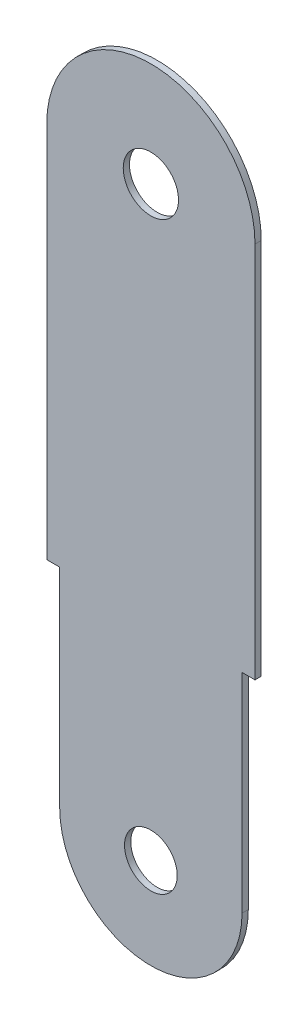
ISO-10303-21;
HEADER;
FILE_DESCRIPTION(('STEP AP214'),'2;1');
FILE_NAME('part.step','',(''),(''),'','','');
FILE_SCHEMA(('AUTOMOTIVE_DESIGN { 1 0 10303 214 1 1 1 1 }'));
ENDSEC;
DATA;
#1=APPLICATION_CONTEXT('core data for automotive mechanical design processes');
#2=APPLICATION_PROTOCOL_DEFINITION('international standard','automotive_design',2000,#1);
#3=PRODUCT_CONTEXT('',#1,'mechanical');
#4=PRODUCT('Part','Part','',(#3));
#5=PRODUCT_RELATED_PRODUCT_CATEGORY('part','',(#4));
#6=PRODUCT_DEFINITION_FORMATION('','',#4);
#7=PRODUCT_DEFINITION_CONTEXT('part definition',#1,'design');
#8=PRODUCT_DEFINITION('design','',#6,#7);
#9=PRODUCT_DEFINITION_SHAPE('','',#8);
#10=(LENGTH_UNIT() NAMED_UNIT(*) SI_UNIT(.MILLI.,.METRE.));
#11=(NAMED_UNIT(*) PLANE_ANGLE_UNIT() SI_UNIT($,.RADIAN.));
#12=(NAMED_UNIT(*) SI_UNIT($,.STERADIAN.) SOLID_ANGLE_UNIT());
#13=UNCERTAINTY_MEASURE_WITH_UNIT(LENGTH_MEASURE(1.E-05),#10,'distance_accuracy_value','');
#14=(GEOMETRIC_REPRESENTATION_CONTEXT(3) GLOBAL_UNCERTAINTY_ASSIGNED_CONTEXT((#13)) GLOBAL_UNIT_ASSIGNED_CONTEXT((#10,
#11,#12)) REPRESENTATION_CONTEXT('',''));
#15=CARTESIAN_POINT('',(0.,0.,0.));
#16=DIRECTION('',(0.,0.,1.));
#17=DIRECTION('',(1.,0.,0.));
#18=AXIS2_PLACEMENT_3D('',#15,#16,#17);
#19=CARTESIAN_POINT('',(-59.4530686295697,-35.0116548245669,1.524));
#20=DIRECTION('',(0.,0.,1.));
#21=DIRECTION('',(1.,0.,0.));
#22=AXIS2_PLACEMENT_3D('',#19,#20,#21);
#23=PLANE('',#22);
#24=CARTESIAN_POINT('',(-59.4530686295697,-35.0116548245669,1.524));
#25=DIRECTION('',(0.,0.,1.));
#26=DIRECTION('',(1.,0.,0.));
#27=AXIS2_PLACEMENT_3D('',#24,#25,#26);
#28=CIRCLE('',#27,6.7437);
#29=CARTESIAN_POINT('',(-66.1967686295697,-35.0116548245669,1.524));
#30=VERTEX_POINT('',#29);
#31=EDGE_CURVE('E135',#30,#30,#28,.T.);
#32=ORIENTED_EDGE('',*,*,#31,.F.);
#33=EDGE_LOOP('',(#32));
#34=FACE_BOUND('',#33,.T.);
#35=CARTESIAN_POINT('',(-59.4530686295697,-35.0116548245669,1.524));
#36=DIRECTION('',(0.,0.,1.));
#37=DIRECTION('',(1.,0.,0.));
#38=AXIS2_PLACEMENT_3D('',#35,#36,#37);
#39=CIRCLE('',#38,25.4);
#40=CARTESIAN_POINT('',(-34.0530686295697,-35.0116548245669,1.524));
#41=VERTEX_POINT('',#40);
#42=CARTESIAN_POINT('',(-84.8530686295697,-35.0116548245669,1.524));
#43=VERTEX_POINT('',#42);
#44=EDGE_CURVE('E146',#41,#43,#39,.T.);
#45=ORIENTED_EDGE('',*,*,#44,.T.);
#46=DIRECTION('',(0.,-1.,0.));
#47=VECTOR('',#46,1.);
#48=CARTESIAN_POINT('',(-84.8530686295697,-35.0116548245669,1.524));
#49=LINE('',#48,#47);
#50=CARTESIAN_POINT('',(-84.8530686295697,-127.07412463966,1.524));
#51=VERTEX_POINT('',#50);
#52=EDGE_CURVE('E94',#43,#51,#49,.T.);
#53=ORIENTED_EDGE('',*,*,#52,.T.);
#54=DIRECTION('',(1.,0.,0.));
#55=VECTOR('',#54,1.);
#56=CARTESIAN_POINT('',(-84.8530686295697,-127.07412463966,1.524));
#57=LINE('',#56,#55);
#58=CARTESIAN_POINT('',(-81.6948110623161,-127.07412463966,1.524));
#59=VERTEX_POINT('',#58);
#60=EDGE_CURVE('E161',#51,#59,#57,.T.);
#61=ORIENTED_EDGE('',*,*,#60,.T.);
#62=DIRECTION('',(0.,-1.,0.));
#63=VECTOR('',#62,1.);
#64=CARTESIAN_POINT('',(-81.6948110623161,-127.07412463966,1.524));
#65=LINE('',#64,#63);
#66=CARTESIAN_POINT('',(-81.6948110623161,-177.922739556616,1.524));
#67=VERTEX_POINT('',#66);
#68=EDGE_CURVE('E174',#59,#67,#65,.T.);
#69=ORIENTED_EDGE('',*,*,#68,.T.);
#70=CARTESIAN_POINT('',(-59.4530686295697,-177.922739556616,1.524));
#71=DIRECTION('',(0.,0.,1.));
#72=DIRECTION('',(1.,0.,0.));
#73=AXIS2_PLACEMENT_3D('',#70,#71,#72);
#74=CIRCLE('',#73,22.2417424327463);
#75=CARTESIAN_POINT('',(-37.2113261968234,-177.922739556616,1.524));
#76=VERTEX_POINT('',#75);
#77=EDGE_CURVE('E113',#67,#76,#74,.T.);
#78=ORIENTED_EDGE('',*,*,#77,.T.);
#79=DIRECTION('',(0.,1.,0.));
#80=VECTOR('',#79,1.);
#81=CARTESIAN_POINT('',(-37.2113261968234,-127.07412463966,1.524));
#82=LINE('',#81,#80);
#83=CARTESIAN_POINT('',(-37.2113261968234,-127.07412463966,1.524));
#84=VERTEX_POINT('',#83);
#85=EDGE_CURVE('E107',#76,#84,#82,.T.);
#86=ORIENTED_EDGE('',*,*,#85,.T.);
#87=DIRECTION('',(1.,0.,0.));
#88=VECTOR('',#87,1.);
#89=CARTESIAN_POINT('',(-34.0530686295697,-127.07412463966,1.524));
#90=LINE('',#89,#88);
#91=CARTESIAN_POINT('',(-34.0530686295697,-127.07412463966,1.524));
#92=VERTEX_POINT('',#91);
#93=EDGE_CURVE('E111',#84,#92,#90,.T.);
#94=ORIENTED_EDGE('',*,*,#93,.T.);
#95=DIRECTION('',(0.,1.,0.));
#96=VECTOR('',#95,1.);
#97=CARTESIAN_POINT('',(-34.0530686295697,-35.0116548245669,1.524));
#98=LINE('',#97,#96);
#99=EDGE_CURVE('E51',#92,#41,#98,.T.);
#100=ORIENTED_EDGE('',*,*,#99,.T.);
#101=EDGE_LOOP('',(#45,#53,#61,#69,#78,#86,#94,#100));
#102=FACE_BOUND('',#101,.T.);
#103=CARTESIAN_POINT('',(-59.4530686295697,-177.922739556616,1.524));
#104=DIRECTION('',(0.,0.,1.));
#105=DIRECTION('',(1.,0.,0.));
#106=AXIS2_PLACEMENT_3D('',#103,#104,#105);
#107=CIRCLE('',#106,6.42619999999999);
#108=CARTESIAN_POINT('',(-65.8792686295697,-177.922739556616,1.524));
#109=VERTEX_POINT('',#108);
#110=EDGE_CURVE('E183',#109,#109,#107,.T.);
#111=ORIENTED_EDGE('',*,*,#110,.F.);
#112=EDGE_LOOP('',(#111));
#113=FACE_BOUND('',#112,.T.);
#114=ADVANCED_FACE('F34',(#34,#102,#113),#23,.T.);
#115=CARTESIAN_POINT('',(-59.4530686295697,-35.0116548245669,0.));
#116=DIRECTION('',(0.,0.,1.));
#117=DIRECTION('',(1.,0.,0.));
#118=AXIS2_PLACEMENT_3D('',#115,#116,#117);
#119=PLANE('',#118);
#120=CARTESIAN_POINT('',(-59.4530686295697,-35.0116548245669,0.));
#121=DIRECTION('',(0.,0.,1.));
#122=DIRECTION('',(1.,0.,0.));
#123=AXIS2_PLACEMENT_3D('',#120,#121,#122);
#124=CIRCLE('',#123,6.7437);
#125=CARTESIAN_POINT('',(-66.1967686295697,-35.0116548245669,0.));
#126=VERTEX_POINT('',#125);
#127=EDGE_CURVE('E180',#126,#126,#124,.T.);
#128=ORIENTED_EDGE('',*,*,#127,.T.);
#129=EDGE_LOOP('',(#128));
#130=FACE_BOUND('',#129,.T.);
#131=CARTESIAN_POINT('',(-59.4530686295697,-35.0116548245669,0.));
#132=DIRECTION('',(0.,0.,1.));
#133=DIRECTION('',(1.,0.,0.));
#134=AXIS2_PLACEMENT_3D('',#131,#132,#133);
#135=CIRCLE('',#134,25.4);
#136=CARTESIAN_POINT('',(-34.0530686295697,-35.0116548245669,0.));
#137=VERTEX_POINT('',#136);
#138=CARTESIAN_POINT('',(-84.8530686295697,-35.0116548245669,0.));
#139=VERTEX_POINT('',#138);
#140=EDGE_CURVE('E131',#137,#139,#135,.T.);
#141=ORIENTED_EDGE('',*,*,#140,.F.);
#142=DIRECTION('',(0.,1.,0.));
#143=VECTOR('',#142,1.);
#144=CARTESIAN_POINT('',(-34.0530686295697,-35.0116548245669,0.));
#145=LINE('',#144,#143);
#146=CARTESIAN_POINT('',(-34.0530686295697,-127.07412463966,0.));
#147=VERTEX_POINT('',#146);
#148=EDGE_CURVE('E86',#147,#137,#145,.T.);
#149=ORIENTED_EDGE('',*,*,#148,.F.);
#150=DIRECTION('',(1.,0.,0.));
#151=VECTOR('',#150,1.);
#152=CARTESIAN_POINT('',(-34.0530686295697,-127.07412463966,0.));
#153=LINE('',#152,#151);
#154=CARTESIAN_POINT('',(-37.2113261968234,-127.07412463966,0.));
#155=VERTEX_POINT('',#154);
#156=EDGE_CURVE('E80',#155,#147,#153,.T.);
#157=ORIENTED_EDGE('',*,*,#156,.F.);
#158=DIRECTION('',(0.,1.,0.));
#159=VECTOR('',#158,1.);
#160=CARTESIAN_POINT('',(-37.2113261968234,-127.07412463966,0.));
#161=LINE('',#160,#159);
#162=CARTESIAN_POINT('',(-37.2113261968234,-177.922739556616,0.));
#163=VERTEX_POINT('',#162);
#164=EDGE_CURVE('E121',#163,#155,#161,.T.);
#165=ORIENTED_EDGE('',*,*,#164,.F.);
#166=CARTESIAN_POINT('',(-59.4530686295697,-177.922739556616,0.));
#167=DIRECTION('',(0.,0.,1.));
#168=DIRECTION('',(1.,0.,0.));
#169=AXIS2_PLACEMENT_3D('',#166,#167,#168);
#170=CIRCLE('',#169,22.2417424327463);
#171=CARTESIAN_POINT('',(-81.6948110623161,-177.922739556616,0.));
#172=VERTEX_POINT('',#171);
#173=EDGE_CURVE('E141',#172,#163,#170,.T.);
#174=ORIENTED_EDGE('',*,*,#173,.F.);
#175=DIRECTION('',(0.,-1.,0.));
#176=VECTOR('',#175,1.);
#177=CARTESIAN_POINT('',(-81.6948110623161,-127.07412463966,0.));
#178=LINE('',#177,#176);
#179=CARTESIAN_POINT('',(-81.6948110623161,-127.07412463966,0.));
#180=VERTEX_POINT('',#179);
#181=EDGE_CURVE('E139',#180,#172,#178,.T.);
#182=ORIENTED_EDGE('',*,*,#181,.F.);
#183=DIRECTION('',(1.,0.,0.));
#184=VECTOR('',#183,1.);
#185=CARTESIAN_POINT('',(-84.8530686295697,-127.07412463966,0.));
#186=LINE('',#185,#184);
#187=CARTESIAN_POINT('',(-84.8530686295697,-127.07412463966,0.));
#188=VERTEX_POINT('',#187);
#189=EDGE_CURVE('E137',#188,#180,#186,.T.);
#190=ORIENTED_EDGE('',*,*,#189,.F.);
#191=DIRECTION('',(0.,-1.,0.));
#192=VECTOR('',#191,1.);
#193=CARTESIAN_POINT('',(-84.8530686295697,-35.0116548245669,0.));
#194=LINE('',#193,#192);
#195=EDGE_CURVE('E134',#139,#188,#194,.T.);
#196=ORIENTED_EDGE('',*,*,#195,.F.);
#197=EDGE_LOOP('',(#141,#149,#157,#165,#174,#182,#190,#196));
#198=FACE_BOUND('',#197,.T.);
#199=CARTESIAN_POINT('',(-59.4530686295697,-177.922739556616,0.));
#200=DIRECTION('',(0.,0.,1.));
#201=DIRECTION('',(1.,0.,0.));
#202=AXIS2_PLACEMENT_3D('',#199,#200,#201);
#203=CIRCLE('',#202,6.42619999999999);
#204=CARTESIAN_POINT('',(-65.8792686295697,-177.922739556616,0.));
#205=VERTEX_POINT('',#204);
#206=EDGE_CURVE('E186',#205,#205,#203,.T.);
#207=ORIENTED_EDGE('',*,*,#206,.T.);
#208=EDGE_LOOP('',(#207));
#209=FACE_BOUND('',#208,.T.);
#210=ADVANCED_FACE('F165',(#130,#198,#209),#119,.F.);
#211=CARTESIAN_POINT('',(-59.4530686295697,-35.0116548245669,1.524));
#212=DIRECTION('',(0.,0.,-1.));
#213=DIRECTION('',(-1.,0.,0.));
#214=AXIS2_PLACEMENT_3D('',#211,#212,#213);
#215=CYLINDRICAL_SURFACE('',#214,25.4);
#216=ORIENTED_EDGE('',*,*,#140,.T.);
#217=DIRECTION('',(0.,0.,-1.));
#218=VECTOR('',#217,1.);
#219=CARTESIAN_POINT('',(-84.8530686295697,-35.0116548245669,1.524));
#220=LINE('',#219,#218);
#221=EDGE_CURVE('E11',#43,#139,#220,.T.);
#222=ORIENTED_EDGE('',*,*,#221,.F.);
#223=ORIENTED_EDGE('',*,*,#44,.F.);
#224=DIRECTION('',(0.,0.,-1.));
#225=VECTOR('',#224,1.);
#226=CARTESIAN_POINT('',(-34.0530686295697,-35.0116548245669,1.524));
#227=LINE('',#226,#225);
#228=EDGE_CURVE('E127',#41,#137,#227,.T.);
#229=ORIENTED_EDGE('',*,*,#228,.T.);
#230=EDGE_LOOP('',(#216,#222,#223,#229));
#231=FACE_BOUND('',#230,.T.);
#232=ADVANCED_FACE('F36',(#231),#215,.T.);
#233=CARTESIAN_POINT('',(-84.8530686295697,-35.0116548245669,1.524));
#234=DIRECTION('',(1.,0.,0.));
#235=DIRECTION('',(0.,0.,-1.));
#236=AXIS2_PLACEMENT_3D('',#233,#234,#235);
#237=PLANE('',#236);
#238=ORIENTED_EDGE('',*,*,#195,.T.);
#239=DIRECTION('',(0.,0.,-1.));
#240=VECTOR('',#239,1.);
#241=CARTESIAN_POINT('',(-84.8530686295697,-127.07412463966,1.524));
#242=LINE('',#241,#240);
#243=EDGE_CURVE('E43',#51,#188,#242,.T.);
#244=ORIENTED_EDGE('',*,*,#243,.F.);
#245=ORIENTED_EDGE('',*,*,#52,.F.);
#246=ORIENTED_EDGE('',*,*,#221,.T.);
#247=EDGE_LOOP('',(#238,#244,#245,#246));
#248=FACE_BOUND('',#247,.T.);
#249=ADVANCED_FACE('F219',(#248),#237,.F.);
#250=CARTESIAN_POINT('',(-84.8530686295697,-127.07412463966,1.524));
#251=DIRECTION('',(0.,1.,0.));
#252=DIRECTION('',(0.,0.,1.));
#253=AXIS2_PLACEMENT_3D('',#250,#251,#252);
#254=PLANE('',#253);
#255=ORIENTED_EDGE('',*,*,#189,.T.);
#256=DIRECTION('',(0.,0.,-1.));
#257=VECTOR('',#256,1.);
#258=CARTESIAN_POINT('',(-81.6948110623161,-127.07412463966,1.524));
#259=LINE('',#258,#257);
#260=EDGE_CURVE('E153',#59,#180,#259,.T.);
#261=ORIENTED_EDGE('',*,*,#260,.F.);
#262=ORIENTED_EDGE('',*,*,#60,.F.);
#263=ORIENTED_EDGE('',*,*,#243,.T.);
#264=EDGE_LOOP('',(#255,#261,#262,#263));
#265=FACE_BOUND('',#264,.T.);
#266=ADVANCED_FACE('F159',(#265),#254,.F.);
#267=CARTESIAN_POINT('',(-81.6948110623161,-127.07412463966,1.524));
#268=DIRECTION('',(1.,0.,0.));
#269=DIRECTION('',(0.,0.,-1.));
#270=AXIS2_PLACEMENT_3D('',#267,#268,#269);
#271=PLANE('',#270);
#272=ORIENTED_EDGE('',*,*,#181,.T.);
#273=DIRECTION('',(0.,0.,-1.));
#274=VECTOR('',#273,1.);
#275=CARTESIAN_POINT('',(-81.6948110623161,-177.922739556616,1.524));
#276=LINE('',#275,#274);
#277=EDGE_CURVE('E150',#67,#172,#276,.T.);
#278=ORIENTED_EDGE('',*,*,#277,.F.);
#279=ORIENTED_EDGE('',*,*,#68,.F.);
#280=ORIENTED_EDGE('',*,*,#260,.T.);
#281=EDGE_LOOP('',(#272,#278,#279,#280));
#282=FACE_BOUND('',#281,.T.);
#283=ADVANCED_FACE('F170',(#282),#271,.F.);
#284=CARTESIAN_POINT('',(-59.4530686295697,-177.922739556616,1.524));
#285=DIRECTION('',(0.,0.,-1.));
#286=DIRECTION('',(-1.,0.,0.));
#287=AXIS2_PLACEMENT_3D('',#284,#285,#286);
#288=CYLINDRICAL_SURFACE('',#287,22.2417424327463);
#289=ORIENTED_EDGE('',*,*,#173,.T.);
#290=DIRECTION('',(0.,0.,-1.));
#291=VECTOR('',#290,1.);
#292=CARTESIAN_POINT('',(-37.2113261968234,-177.922739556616,1.524));
#293=LINE('',#292,#291);
#294=EDGE_CURVE('E122',#76,#163,#293,.T.);
#295=ORIENTED_EDGE('',*,*,#294,.F.);
#296=ORIENTED_EDGE('',*,*,#77,.F.);
#297=ORIENTED_EDGE('',*,*,#277,.T.);
#298=EDGE_LOOP('',(#289,#295,#296,#297));
#299=FACE_BOUND('',#298,.T.);
#300=ADVANCED_FACE('F173',(#299),#288,.T.);
#301=CARTESIAN_POINT('',(-37.2113261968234,-127.07412463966,1.524));
#302=DIRECTION('',(-1.,0.,0.));
#303=DIRECTION('',(0.,-1.,0.));
#304=AXIS2_PLACEMENT_3D('',#301,#302,#303);
#305=PLANE('',#304);
#306=ORIENTED_EDGE('',*,*,#164,.T.);
#307=DIRECTION('',(0.,0.,-1.));
#308=VECTOR('',#307,1.);
#309=CARTESIAN_POINT('',(-37.2113261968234,-127.07412463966,1.524));
#310=LINE('',#309,#308);
#311=EDGE_CURVE('E118',#84,#155,#310,.T.);
#312=ORIENTED_EDGE('',*,*,#311,.F.);
#313=ORIENTED_EDGE('',*,*,#85,.F.);
#314=ORIENTED_EDGE('',*,*,#294,.T.);
#315=EDGE_LOOP('',(#306,#312,#313,#314));
#316=FACE_BOUND('',#315,.T.);
#317=ADVANCED_FACE('F119',(#316),#305,.F.);
#318=CARTESIAN_POINT('',(-34.0530686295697,-127.07412463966,1.524));
#319=DIRECTION('',(0.,1.,0.));
#320=DIRECTION('',(-1.,0.,0.));
#321=AXIS2_PLACEMENT_3D('',#318,#319,#320);
#322=PLANE('',#321);
#323=ORIENTED_EDGE('',*,*,#156,.T.);
#324=DIRECTION('',(0.,0.,-1.));
#325=VECTOR('',#324,1.);
#326=CARTESIAN_POINT('',(-34.0530686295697,-127.07412463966,1.524));
#327=LINE('',#326,#325);
#328=EDGE_CURVE('E123',#92,#147,#327,.T.);
#329=ORIENTED_EDGE('',*,*,#328,.F.);
#330=ORIENTED_EDGE('',*,*,#93,.F.);
#331=ORIENTED_EDGE('',*,*,#311,.T.);
#332=EDGE_LOOP('',(#323,#329,#330,#331));
#333=FACE_BOUND('',#332,.T.);
#334=ADVANCED_FACE('F125',(#333),#322,.F.);
#335=CARTESIAN_POINT('',(-34.0530686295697,-35.0116548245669,1.524));
#336=DIRECTION('',(-1.,0.,0.));
#337=DIRECTION('',(0.,0.,1.));
#338=AXIS2_PLACEMENT_3D('',#335,#336,#337);
#339=PLANE('',#338);
#340=ORIENTED_EDGE('',*,*,#148,.T.);
#341=ORIENTED_EDGE('',*,*,#228,.F.);
#342=ORIENTED_EDGE('',*,*,#99,.F.);
#343=ORIENTED_EDGE('',*,*,#328,.T.);
#344=EDGE_LOOP('',(#340,#341,#342,#343));
#345=FACE_BOUND('',#344,.T.);
#346=ADVANCED_FACE('F207',(#345),#339,.F.);
#347=CARTESIAN_POINT('',(-59.4530686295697,-35.0116548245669,1.524));
#348=DIRECTION('',(0.,0.,-1.));
#349=DIRECTION('',(-1.,0.,0.));
#350=AXIS2_PLACEMENT_3D('',#347,#348,#349);
#351=CYLINDRICAL_SURFACE('',#350,6.7437);
#352=CARTESIAN_POINT('',(-66.1967686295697,-35.0116548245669,1.524));
#353=CARTESIAN_POINT('',(-66.1967686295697,-35.0116548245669,1.508125));
#354=CARTESIAN_POINT('',(-66.1967686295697,-35.0116548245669,1.49225));
#355=CARTESIAN_POINT('',(-66.1967686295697,-35.0116548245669,1.4605));
#356=CARTESIAN_POINT('',(-66.1967686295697,-35.0116548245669,1.444625));
#357=CARTESIAN_POINT('',(-66.1967686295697,-35.0116548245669,1.412875));
#358=CARTESIAN_POINT('',(-66.1967686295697,-35.0116548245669,1.397));
#359=CARTESIAN_POINT('',(-66.1967686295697,-35.0116548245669,1.36525));
#360=CARTESIAN_POINT('',(-66.1967686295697,-35.0116548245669,1.349375));
#361=CARTESIAN_POINT('',(-66.1967686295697,-35.0116548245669,1.317625));
#362=CARTESIAN_POINT('',(-66.1967686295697,-35.0116548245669,1.30175));
#363=CARTESIAN_POINT('',(-66.1967686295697,-35.0116548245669,1.27));
#364=CARTESIAN_POINT('',(-66.1967686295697,-35.0116548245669,1.254125));
#365=CARTESIAN_POINT('',(-66.1967686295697,-35.0116548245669,1.222375));
#366=CARTESIAN_POINT('',(-66.1967686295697,-35.0116548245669,1.2065));
#367=CARTESIAN_POINT('',(-66.1967686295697,-35.0116548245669,1.17475));
#368=CARTESIAN_POINT('',(-66.1967686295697,-35.0116548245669,1.158875));
#369=CARTESIAN_POINT('',(-66.1967686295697,-35.0116548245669,1.127125));
#370=CARTESIAN_POINT('',(-66.1967686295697,-35.0116548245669,1.11125));
#371=CARTESIAN_POINT('',(-66.1967686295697,-35.0116548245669,1.0795));
#372=CARTESIAN_POINT('',(-66.1967686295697,-35.0116548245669,1.063625));
#373=CARTESIAN_POINT('',(-66.1967686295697,-35.0116548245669,1.031875));
#374=CARTESIAN_POINT('',(-66.1967686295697,-35.0116548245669,1.016));
#375=CARTESIAN_POINT('',(-66.1967686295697,-35.0116548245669,0.98425));
#376=CARTESIAN_POINT('',(-66.1967686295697,-35.0116548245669,0.968375));
#377=CARTESIAN_POINT('',(-66.1967686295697,-35.0116548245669,0.936625));
#378=CARTESIAN_POINT('',(-66.1967686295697,-35.0116548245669,0.92075));
#379=CARTESIAN_POINT('',(-66.1967686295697,-35.0116548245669,0.889));
#380=CARTESIAN_POINT('',(-66.1967686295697,-35.0116548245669,0.873125));
#381=CARTESIAN_POINT('',(-66.1967686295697,-35.0116548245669,0.841375));
#382=CARTESIAN_POINT('',(-66.1967686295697,-35.0116548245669,0.8255));
#383=CARTESIAN_POINT('',(-66.1967686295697,-35.0116548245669,0.79375));
#384=CARTESIAN_POINT('',(-66.1967686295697,-35.0116548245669,0.777875));
#385=CARTESIAN_POINT('',(-66.1967686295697,-35.0116548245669,0.746125));
#386=CARTESIAN_POINT('',(-66.1967686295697,-35.0116548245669,0.73025));
#387=CARTESIAN_POINT('',(-66.1967686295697,-35.0116548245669,0.6985));
#388=CARTESIAN_POINT('',(-66.1967686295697,-35.0116548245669,0.682625));
#389=CARTESIAN_POINT('',(-66.1967686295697,-35.0116548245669,0.650875));
#390=CARTESIAN_POINT('',(-66.1967686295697,-35.0116548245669,0.635));
#391=CARTESIAN_POINT('',(-66.1967686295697,-35.0116548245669,0.60325));
#392=CARTESIAN_POINT('',(-66.1967686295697,-35.0116548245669,0.587375));
#393=CARTESIAN_POINT('',(-66.1967686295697,-35.0116548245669,0.555625));
#394=CARTESIAN_POINT('',(-66.1967686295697,-35.0116548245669,0.53975));
#395=CARTESIAN_POINT('',(-66.1967686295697,-35.0116548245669,0.508));
#396=CARTESIAN_POINT('',(-66.1967686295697,-35.0116548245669,0.492125));
#397=CARTESIAN_POINT('',(-66.1967686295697,-35.0116548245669,0.460375));
#398=CARTESIAN_POINT('',(-66.1967686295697,-35.0116548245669,0.4445));
#399=CARTESIAN_POINT('',(-66.1967686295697,-35.0116548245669,0.41275));
#400=CARTESIAN_POINT('',(-66.1967686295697,-35.0116548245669,0.396875));
#401=CARTESIAN_POINT('',(-66.1967686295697,-35.0116548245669,0.365125));
#402=CARTESIAN_POINT('',(-66.1967686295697,-35.0116548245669,0.34925));
#403=CARTESIAN_POINT('',(-66.1967686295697,-35.0116548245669,0.3175));
#404=CARTESIAN_POINT('',(-66.1967686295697,-35.0116548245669,0.301625));
#405=CARTESIAN_POINT('',(-66.1967686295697,-35.0116548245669,0.269875));
#406=CARTESIAN_POINT('',(-66.1967686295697,-35.0116548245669,0.254));
#407=CARTESIAN_POINT('',(-66.1967686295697,-35.0116548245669,0.22225));
#408=CARTESIAN_POINT('',(-66.1967686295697,-35.0116548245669,0.206375));
#409=CARTESIAN_POINT('',(-66.1967686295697,-35.0116548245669,0.174625));
#410=CARTESIAN_POINT('',(-66.1967686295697,-35.0116548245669,0.15875));
#411=CARTESIAN_POINT('',(-66.1967686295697,-35.0116548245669,0.127));
#412=CARTESIAN_POINT('',(-66.1967686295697,-35.0116548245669,0.111125));
#413=CARTESIAN_POINT('',(-66.1967686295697,-35.0116548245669,0.079375));
#414=CARTESIAN_POINT('',(-66.1967686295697,-35.0116548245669,0.0635));
#415=CARTESIAN_POINT('',(-66.1967686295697,-35.0116548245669,0.0317499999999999));
#416=CARTESIAN_POINT('',(-66.1967686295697,-35.0116548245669,0.015875));
#417=CARTESIAN_POINT('',(-66.1967686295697,-35.0116548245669,0.));
#418=B_SPLINE_CURVE_WITH_KNOTS('',3,(#352,#353,#354,#355,#356,#357,#358,#359,#360,#361,#362,
#363,#364,#365,#366,#367,#368,#369,#370,#371,#372,#373,#374,#375,#376,#377,#378,#379,#380,#381,
#382,#383,#384,#385,#386,#387,#388,#389,#390,#391,#392,#393,#394,#395,#396,#397,#398,#399,#400,
#401,#402,#403,#404,#405,#406,#407,#408,#409,#410,#411,#412,#413,#414,#415,#416,#417),
.UNSPECIFIED.,.F.,.F.,(4,2,2,2,2,2,2,2,2,2,2,2,2,2,2,2,2,2,2,2,2,2,2,2,2,2,2,2,2,2,2,2,4),(0.,
0.0476249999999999,0.0952499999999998,0.142875,0.1905,0.238125,0.28575,0.333375,0.381,0.428625,
0.47625,0.523875,0.5715,0.619125,0.66675,0.714375,0.762,0.809625,0.85725,0.904875,0.9525,
1.000125,1.04775,1.095375,1.143,1.190625,1.23825,1.285875,1.3335,1.381125,1.42875,1.476375,
1.524),.UNSPECIFIED.);
#419=EDGE_CURVE('BSEAM204',#30,#126,#418,.T.);
#420=ORIENTED_EDGE('',*,*,#31,.T.);
#421=ORIENTED_EDGE('',*,*,#127,.F.);
#422=ORIENTED_EDGE('',*,*,#419,.T.);
#423=ORIENTED_EDGE('',*,*,#419,.F.);
#424=EDGE_LOOP('',(#420,#422,#421,#423));
#425=FACE_BOUND('',#424,.T.);
#426=ADVANCED_FACE('F204',(#425),#351,.F.);
#427=CARTESIAN_POINT('',(-59.4530686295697,-177.922739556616,1.524));
#428=DIRECTION('',(0.,0.,-1.));
#429=DIRECTION('',(-1.,0.,0.));
#430=AXIS2_PLACEMENT_3D('',#427,#428,#429);
#431=CYLINDRICAL_SURFACE('',#430,6.42619999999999);
#432=CARTESIAN_POINT('',(-65.8792686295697,-177.922739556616,1.524));
#433=CARTESIAN_POINT('',(-65.8792686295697,-177.922739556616,1.508125));
#434=CARTESIAN_POINT('',(-65.8792686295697,-177.922739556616,1.49225));
#435=CARTESIAN_POINT('',(-65.8792686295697,-177.922739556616,1.4605));
#436=CARTESIAN_POINT('',(-65.8792686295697,-177.922739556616,1.444625));
#437=CARTESIAN_POINT('',(-65.8792686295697,-177.922739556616,1.412875));
#438=CARTESIAN_POINT('',(-65.8792686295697,-177.922739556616,1.397));
#439=CARTESIAN_POINT('',(-65.8792686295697,-177.922739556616,1.36525));
#440=CARTESIAN_POINT('',(-65.8792686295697,-177.922739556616,1.349375));
#441=CARTESIAN_POINT('',(-65.8792686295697,-177.922739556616,1.317625));
#442=CARTESIAN_POINT('',(-65.8792686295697,-177.922739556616,1.30175));
#443=CARTESIAN_POINT('',(-65.8792686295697,-177.922739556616,1.27));
#444=CARTESIAN_POINT('',(-65.8792686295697,-177.922739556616,1.254125));
#445=CARTESIAN_POINT('',(-65.8792686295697,-177.922739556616,1.222375));
#446=CARTESIAN_POINT('',(-65.8792686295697,-177.922739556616,1.2065));
#447=CARTESIAN_POINT('',(-65.8792686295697,-177.922739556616,1.17475));
#448=CARTESIAN_POINT('',(-65.8792686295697,-177.922739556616,1.158875));
#449=CARTESIAN_POINT('',(-65.8792686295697,-177.922739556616,1.127125));
#450=CARTESIAN_POINT('',(-65.8792686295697,-177.922739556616,1.11125));
#451=CARTESIAN_POINT('',(-65.8792686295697,-177.922739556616,1.0795));
#452=CARTESIAN_POINT('',(-65.8792686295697,-177.922739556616,1.063625));
#453=CARTESIAN_POINT('',(-65.8792686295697,-177.922739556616,1.031875));
#454=CARTESIAN_POINT('',(-65.8792686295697,-177.922739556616,1.016));
#455=CARTESIAN_POINT('',(-65.8792686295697,-177.922739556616,0.98425));
#456=CARTESIAN_POINT('',(-65.8792686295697,-177.922739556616,0.968375));
#457=CARTESIAN_POINT('',(-65.8792686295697,-177.922739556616,0.936625));
#458=CARTESIAN_POINT('',(-65.8792686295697,-177.922739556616,0.92075));
#459=CARTESIAN_POINT('',(-65.8792686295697,-177.922739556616,0.889));
#460=CARTESIAN_POINT('',(-65.8792686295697,-177.922739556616,0.873125));
#461=CARTESIAN_POINT('',(-65.8792686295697,-177.922739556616,0.841375));
#462=CARTESIAN_POINT('',(-65.8792686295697,-177.922739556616,0.8255));
#463=CARTESIAN_POINT('',(-65.8792686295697,-177.922739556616,0.79375));
#464=CARTESIAN_POINT('',(-65.8792686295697,-177.922739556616,0.777875));
#465=CARTESIAN_POINT('',(-65.8792686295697,-177.922739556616,0.746125));
#466=CARTESIAN_POINT('',(-65.8792686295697,-177.922739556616,0.73025));
#467=CARTESIAN_POINT('',(-65.8792686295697,-177.922739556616,0.6985));
#468=CARTESIAN_POINT('',(-65.8792686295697,-177.922739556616,0.682625));
#469=CARTESIAN_POINT('',(-65.8792686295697,-177.922739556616,0.650875));
#470=CARTESIAN_POINT('',(-65.8792686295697,-177.922739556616,0.635));
#471=CARTESIAN_POINT('',(-65.8792686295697,-177.922739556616,0.60325));
#472=CARTESIAN_POINT('',(-65.8792686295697,-177.922739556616,0.587375));
#473=CARTESIAN_POINT('',(-65.8792686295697,-177.922739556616,0.555625));
#474=CARTESIAN_POINT('',(-65.8792686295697,-177.922739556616,0.53975));
#475=CARTESIAN_POINT('',(-65.8792686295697,-177.922739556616,0.508));
#476=CARTESIAN_POINT('',(-65.8792686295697,-177.922739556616,0.492125));
#477=CARTESIAN_POINT('',(-65.8792686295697,-177.922739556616,0.460375));
#478=CARTESIAN_POINT('',(-65.8792686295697,-177.922739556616,0.4445));
#479=CARTESIAN_POINT('',(-65.8792686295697,-177.922739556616,0.41275));
#480=CARTESIAN_POINT('',(-65.8792686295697,-177.922739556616,0.396875));
#481=CARTESIAN_POINT('',(-65.8792686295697,-177.922739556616,0.365125));
#482=CARTESIAN_POINT('',(-65.8792686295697,-177.922739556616,0.34925));
#483=CARTESIAN_POINT('',(-65.8792686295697,-177.922739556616,0.3175));
#484=CARTESIAN_POINT('',(-65.8792686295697,-177.922739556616,0.301625));
#485=CARTESIAN_POINT('',(-65.8792686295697,-177.922739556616,0.269875));
#486=CARTESIAN_POINT('',(-65.8792686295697,-177.922739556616,0.254));
#487=CARTESIAN_POINT('',(-65.8792686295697,-177.922739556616,0.22225));
#488=CARTESIAN_POINT('',(-65.8792686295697,-177.922739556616,0.206375));
#489=CARTESIAN_POINT('',(-65.8792686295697,-177.922739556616,0.174625));
#490=CARTESIAN_POINT('',(-65.8792686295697,-177.922739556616,0.15875));
#491=CARTESIAN_POINT('',(-65.8792686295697,-177.922739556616,0.127));
#492=CARTESIAN_POINT('',(-65.8792686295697,-177.922739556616,0.111125));
#493=CARTESIAN_POINT('',(-65.8792686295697,-177.922739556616,0.079375));
#494=CARTESIAN_POINT('',(-65.8792686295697,-177.922739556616,0.0635));
#495=CARTESIAN_POINT('',(-65.8792686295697,-177.922739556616,0.0317499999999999));
#496=CARTESIAN_POINT('',(-65.8792686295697,-177.922739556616,0.015875));
#497=CARTESIAN_POINT('',(-65.8792686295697,-177.922739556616,0.));
#498=B_SPLINE_CURVE_WITH_KNOTS('',3,(#432,#433,#434,#435,#436,#437,#438,#439,#440,#441,#442,
#443,#444,#445,#446,#447,#448,#449,#450,#451,#452,#453,#454,#455,#456,#457,#458,#459,#460,#461,
#462,#463,#464,#465,#466,#467,#468,#469,#470,#471,#472,#473,#474,#475,#476,#477,#478,#479,#480,
#481,#482,#483,#484,#485,#486,#487,#488,#489,#490,#491,#492,#493,#494,#495,#496,#497),
.UNSPECIFIED.,.F.,.F.,(4,2,2,2,2,2,2,2,2,2,2,2,2,2,2,2,2,2,2,2,2,2,2,2,2,2,2,2,2,2,2,2,4),(0.,
0.0476249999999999,0.0952499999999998,0.142875,0.1905,0.238125,0.28575,0.333375,0.381,0.428625,
0.47625,0.523875,0.5715,0.619125,0.66675,0.714375,0.762,0.809625,0.85725,0.904875,0.9525,
1.000125,1.04775,1.095375,1.143,1.190625,1.23825,1.285875,1.3335,1.381125,1.42875,1.476375,
1.524),.UNSPECIFIED.);
#499=EDGE_CURVE('BSEAM192',#109,#205,#498,.T.);
#500=ORIENTED_EDGE('',*,*,#110,.T.);
#501=ORIENTED_EDGE('',*,*,#206,.F.);
#502=ORIENTED_EDGE('',*,*,#499,.T.);
#503=ORIENTED_EDGE('',*,*,#499,.F.);
#504=EDGE_LOOP('',(#500,#502,#501,#503));
#505=FACE_BOUND('',#504,.T.);
#506=ADVANCED_FACE('F192',(#505),#431,.F.);
#507=CLOSED_SHELL('',(#114,#210,#232,#249,#266,#283,#300,#317,#334,#346,#426,#506));
#508=MANIFOLD_SOLID_BREP('B2',#507);
#509=ADVANCED_BREP_SHAPE_REPRESENTATION('',(#18,#508),#14);
#510=SHAPE_DEFINITION_REPRESENTATION(#9,#509);
ENDSEC;
END-ISO-10303-21;
